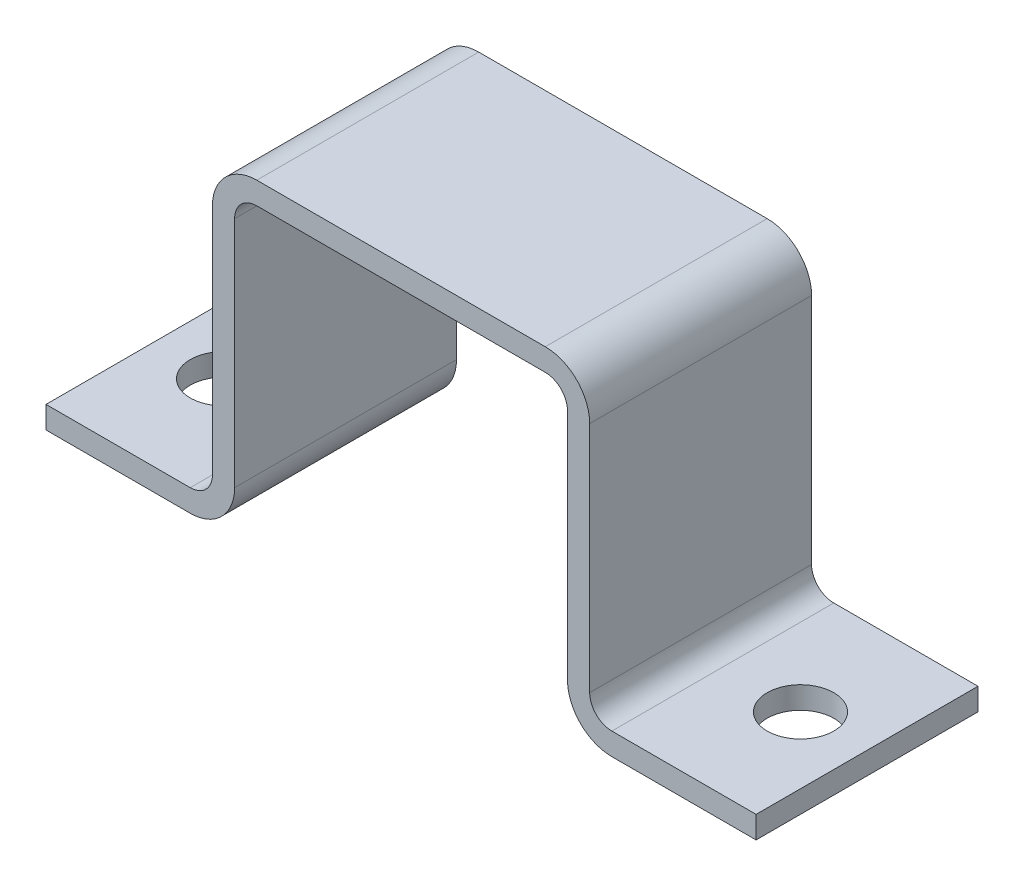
from build123d import *

# Parameters (mm, degrees)
EXTRUSION1_DEPTH        = 20
CONG_1_R                = 2
CONG_2_R                = 4
ESQUISSE2_R             = 3
ENL_V_MAT_EXTRU_1_DEPTH = 73.284161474


with BuildPart() as part:
    # Esquisse1 → Extrusion1 (new body)
    with BuildSketch(Plane.XY):
        Polygon((0, 0), (17, 0), (17, 27), (47, 27), (47, 0), (64, 0), (64, 2), (49, 2), (49, 29), (15, 29), (15, 2), (0, 2), align=None)
    extrude(amount=EXTRUSION1_DEPTH)

    # Cong_1
    cong_1_edges = [part.edges().sort_by_distance(p)[0] for p in [
        (15, 2, 10),
        (49, 2, 10),
        (47, 27, 10),
        (17, 27, 10),
    ]]
    fillet(cong_1_edges, radius=CONG_1_R)

    # Cong_2
    cong_2_edges = [part.edges().sort_by_distance(p)[0] for p in [
        (15, 29, 10),
        (49, 29, 10),
        (47, 0, 10),
        (17, 0, 10),
    ]]
    fillet(cong_2_edges, radius=CONG_2_R)

    # Esquisse2 → Enl_v. mat.-Extru.1 (cut, through all)
    with BuildSketch(Plane(origin=(0, 2, 0), x_dir=(-1, 0, 0), z_dir=(0, 1, 0))):
        with Locations((-58, 10)):
            Circle(ESQUISSE2_R)
        with Locations((-6, 10)):
            Circle(ESQUISSE2_R)
    extrude(amount=-ENL_V_MAT_EXTRU_1_DEPTH, mode=Mode.SUBTRACT)


solid = part.part
